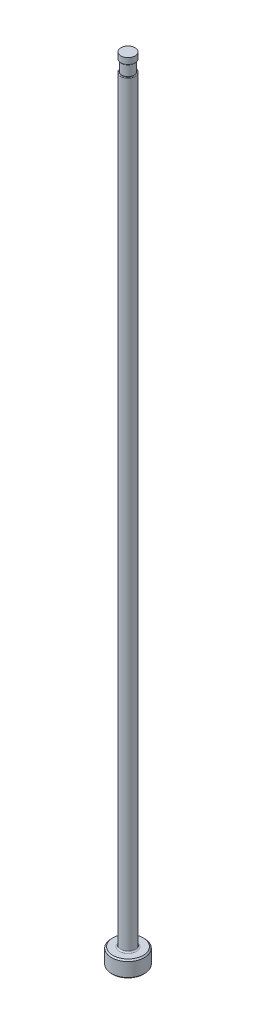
from build123d import *

# Parameters (mm, degrees)
CHAMFER1_SIZE     = 0.254
FILLET1_R         = 0.254
SKETCH2_W         = 0.2032
SKETCH2_H         = 2.032
D_SLOT_DEPTH      = 153.466131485
D_SLOT_DEPTH_BACK = 153.466131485
SKETCH5_W         = 0.01905
SKETCH5_H         = 1.27
FILLET2_R         = 0.127


with BuildPart() as part:
    # Sketch1 → Revolve1 (revolve)
    with BuildSketch(Plane.XY, mode=Mode.PRIVATE) as revolve1_sk:
        Polygon((0, 0), (-3.175, 0), (-3.175, 3.175), (-1.38811, 3.175), (-1.38811, 152.4), (0, 152.4), align=None)
    revolve(revolve1_sk.sketch.rotate(Axis((0, 259.958771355, 0), (0, -1, 0)), 270), axis=Axis((0, 259.958771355, 0), (0, -1, 0)))

    # Chamfer1
    chamfer1_edges = [part.edges().sort_by_distance(p)[0] for p in [
        (0, 3.175, -3.175),
        (0, 0, -3.175),
    ]]
    chamfer(chamfer1_edges, length=CHAMFER1_SIZE)

    # Fillet1
    fillet1_edges = [part.edges().sort_by_distance(p)[0] for p in [
        (0, 3.175, -1.38811),
    ]]
    fillet(fillet1_edges, radius=FILLET1_R)

    # Sketch2 → Vent Relief (revolve, cut)
    with BuildSketch(Plane.XY, mode=Mode.PRIVATE) as vent_relief_sk:
        with Locations((-1.28651, 150.114)):
            Rectangle(SKETCH2_W, SKETCH2_H)
    revolve(vent_relief_sk.sketch.rotate(Axis((0, 153.448281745, 0), (0, -1, 0)), 270), axis=Axis((0, 153.448281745, 0), (0, -1, 0)), mode=Mode.SUBTRACT)

    # Sketch3 → D-Slot (cut, two sides: drawn at the far end of the back side and taken through both)
    with BuildSketch(Plane.XY.offset(-D_SLOT_DEPTH_BACK)):
        with BuildLine():
            Line((-1.18491, 150.114), (-1.18491, 86.614))
            ThreePointArc((-1.18491, 86.614), (-1.236123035, 86.046038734), (-1.38811, 85.4964))
            Line((-1.38811, 85.4964), (-1.38811, 150.114))
            Line((-1.38811, 150.114), (-1.18491, 150.114))
        make_face()
    extrude(amount=D_SLOT_DEPTH + D_SLOT_DEPTH_BACK, mode=Mode.SUBTRACT)

    # Sketch5 → Vent Diameter (revolve, cut)
    with BuildSketch(Plane.XY, mode=Mode.PRIVATE) as vent_diameter_sk:
        with Locations((-1.378585, 151.765)):
            Rectangle(SKETCH5_W, SKETCH5_H)
    revolve(vent_diameter_sk.sketch.rotate(Axis((0, 152.687735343, 0), (0, -1, 0)), 90), axis=Axis((0, 152.687735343, 0), (0, -1, 0)), mode=Mode.SUBTRACT)

    # Fillet2
    fillet2_edges = [part.edges().sort_by_distance(p)[0] for p in [
        (1.210486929, 149.098, -0.679389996),
        (0, 151.13, 1.36906),
    ]]
    fillet(fillet2_edges, radius=FILLET2_R)


solid = part.part
